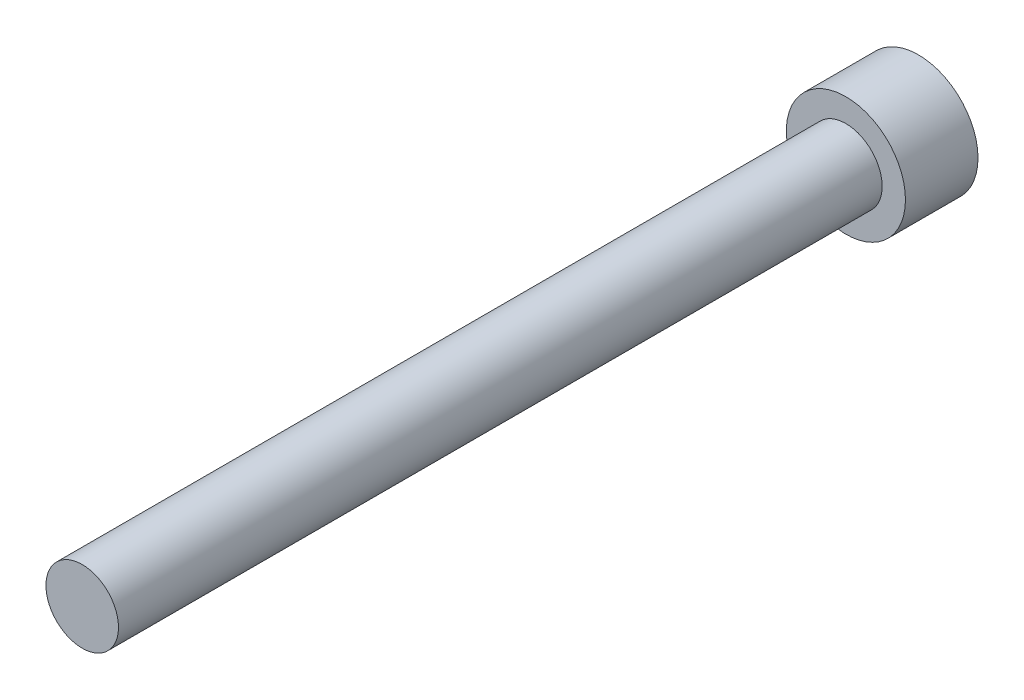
ISO-10303-21;
HEADER;
FILE_DESCRIPTION(('STEP AP214'),'2;1');
FILE_NAME('part.step','',(''),(''),'','','');
FILE_SCHEMA(('AUTOMOTIVE_DESIGN { 1 0 10303 214 1 1 1 1 }'));
ENDSEC;
DATA;
#1=APPLICATION_CONTEXT('core data for automotive mechanical design processes');
#2=APPLICATION_PROTOCOL_DEFINITION('international standard','automotive_design',2000,#1);
#3=PRODUCT_CONTEXT('',#1,'mechanical');
#4=PRODUCT('Part','Part','',(#3));
#5=PRODUCT_RELATED_PRODUCT_CATEGORY('part','',(#4));
#6=PRODUCT_DEFINITION_FORMATION('','',#4);
#7=PRODUCT_DEFINITION_CONTEXT('part definition',#1,'design');
#8=PRODUCT_DEFINITION('design','',#6,#7);
#9=PRODUCT_DEFINITION_SHAPE('','',#8);
#10=(LENGTH_UNIT() NAMED_UNIT(*) SI_UNIT(.MILLI.,.METRE.));
#11=(NAMED_UNIT(*) PLANE_ANGLE_UNIT() SI_UNIT($,.RADIAN.));
#12=(NAMED_UNIT(*) SI_UNIT($,.STERADIAN.) SOLID_ANGLE_UNIT());
#13=UNCERTAINTY_MEASURE_WITH_UNIT(LENGTH_MEASURE(1.E-05),#10,'distance_accuracy_value','');
#14=(GEOMETRIC_REPRESENTATION_CONTEXT(3) GLOBAL_UNCERTAINTY_ASSIGNED_CONTEXT((#13)) GLOBAL_UNIT_ASSIGNED_CONTEXT((#10,
#11,#12)) REPRESENTATION_CONTEXT('',''));
#15=CARTESIAN_POINT('',(0.,0.,0.));
#16=DIRECTION('',(0.,0.,1.));
#17=DIRECTION('',(1.,0.,0.));
#18=AXIS2_PLACEMENT_3D('',#15,#16,#17);
#19=CARTESIAN_POINT('',(0.,0.,50.8));
#20=DIRECTION('',(0.,0.,1.));
#21=DIRECTION('',(1.,0.,0.));
#22=AXIS2_PLACEMENT_3D('',#19,#20,#21);
#23=PLANE('',#22);
#24=CARTESIAN_POINT('',(0.,0.,50.8));
#25=DIRECTION('',(0.,0.,1.));
#26=DIRECTION('',(1.,0.,0.));
#27=AXIS2_PLACEMENT_3D('',#24,#25,#26);
#28=CIRCLE('',#27,2.413);
#29=CARTESIAN_POINT('',(2.413,0.,50.8));
#30=VERTEX_POINT('',#29);
#31=EDGE_CURVE('E11',#30,#30,#28,.T.);
#32=ORIENTED_EDGE('',*,*,#31,.T.);
#33=EDGE_LOOP('',(#32));
#34=FACE_BOUND('',#33,.T.);
#35=ADVANCED_FACE('F37',(#34),#23,.T.);
#36=CARTESIAN_POINT('',(0.,0.,50.8));
#37=DIRECTION('',(0.,0.,1.));
#38=DIRECTION('',(1.,0.,0.));
#39=AXIS2_PLACEMENT_3D('',#36,#37,#38);
#40=CYLINDRICAL_SURFACE('',#39,2.413);
#41=CARTESIAN_POINT('',(0.,0.,0.));
#42=DIRECTION('',(0.,0.,1.));
#43=DIRECTION('',(1.,0.,0.));
#44=AXIS2_PLACEMENT_3D('',#41,#42,#43);
#45=CIRCLE('',#44,2.413);
#46=CARTESIAN_POINT('',(2.413,0.,0.));
#47=VERTEX_POINT('',#46);
#48=EDGE_CURVE('E44',#47,#47,#45,.T.);
#49=ORIENTED_EDGE('',*,*,#48,.T.);
#50=EDGE_LOOP('',(#49));
#51=FACE_BOUND('',#50,.T.);
#52=ORIENTED_EDGE('',*,*,#31,.F.);
#53=EDGE_LOOP('',(#52));
#54=FACE_BOUND('',#53,.T.);
#55=ADVANCED_FACE('F151',(#51,#54),#40,.T.);
#56=CARTESIAN_POINT('',(0.,-2.413,0.));
#57=DIRECTION('',(0.,0.,1.));
#58=DIRECTION('',(1.,0.,0.));
#59=AXIS2_PLACEMENT_3D('',#56,#57,#58);
#60=PLANE('',#59);
#61=CARTESIAN_POINT('',(0.,0.,0.));
#62=DIRECTION('',(0.,0.,1.));
#63=DIRECTION('',(1.,0.,0.));
#64=AXIS2_PLACEMENT_3D('',#61,#62,#63);
#65=CIRCLE('',#64,3.9624);
#66=CARTESIAN_POINT('',(3.9624,0.,0.));
#67=VERTEX_POINT('',#66);
#68=EDGE_CURVE('E146',#67,#67,#65,.T.);
#69=ORIENTED_EDGE('',*,*,#68,.T.);
#70=EDGE_LOOP('',(#69));
#71=FACE_BOUND('',#70,.T.);
#72=ORIENTED_EDGE('',*,*,#48,.F.);
#73=EDGE_LOOP('',(#72));
#74=FACE_BOUND('',#73,.T.);
#75=ADVANCED_FACE('F154',(#71,#74),#60,.T.);
#76=CARTESIAN_POINT('',(0.,0.,50.8));
#77=DIRECTION('',(0.,0.,1.));
#78=DIRECTION('',(1.,0.,0.));
#79=AXIS2_PLACEMENT_3D('',#76,#77,#78);
#80=CYLINDRICAL_SURFACE('',#79,3.9624);
#81=CARTESIAN_POINT('',(0.,0.,-4.826));
#82=DIRECTION('',(0.,0.,1.));
#83=DIRECTION('',(1.,0.,0.));
#84=AXIS2_PLACEMENT_3D('',#81,#82,#83);
#85=CIRCLE('',#84,3.9624);
#86=CARTESIAN_POINT('',(3.9624,0.,-4.826));
#87=VERTEX_POINT('',#86);
#88=EDGE_CURVE('E138',#87,#87,#85,.T.);
#89=ORIENTED_EDGE('',*,*,#88,.T.);
#90=EDGE_LOOP('',(#89));
#91=FACE_BOUND('',#90,.T.);
#92=ORIENTED_EDGE('',*,*,#68,.F.);
#93=EDGE_LOOP('',(#92));
#94=FACE_BOUND('',#93,.T.);
#95=ADVANCED_FACE('F156',(#91,#94),#80,.T.);
#96=CARTESIAN_POINT('',(0.,-3.9624,-4.826));
#97=DIRECTION('',(0.,0.,-1.));
#98=DIRECTION('',(-1.,0.,0.));
#99=AXIS2_PLACEMENT_3D('',#96,#97,#98);
#100=PLANE('',#99);
#101=DIRECTION('',(0.866025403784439,-0.5,0.));
#102=VECTOR('',#101,1.);
#103=CARTESIAN_POINT('',(0.,2.28769270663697,-4.826));
#104=LINE('',#103,#102);
#105=CARTESIAN_POINT('',(0.,2.28769270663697,-4.826));
#106=VERTEX_POINT('',#105);
#107=CARTESIAN_POINT('',(1.9812,1.14384635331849,-4.826));
#108=VERTEX_POINT('',#107);
#109=EDGE_CURVE('E51',#106,#108,#104,.T.);
#110=ORIENTED_EDGE('',*,*,#109,.F.);
#111=DIRECTION('',(0.866025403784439,0.5,0.));
#112=VECTOR('',#111,1.);
#113=CARTESIAN_POINT('',(-1.9812,1.14384635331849,-4.826));
#114=LINE('',#113,#112);
#115=CARTESIAN_POINT('',(-1.9812,1.14384635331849,-4.826));
#116=VERTEX_POINT('',#115);
#117=EDGE_CURVE('E134',#116,#106,#114,.T.);
#118=ORIENTED_EDGE('',*,*,#117,.F.);
#119=DIRECTION('',(0.,1.,0.));
#120=VECTOR('',#119,1.);
#121=CARTESIAN_POINT('',(-1.9812,-1.14384635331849,-4.826));
#122=LINE('',#121,#120);
#123=CARTESIAN_POINT('',(-1.9812,-1.14384635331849,-4.826));
#124=VERTEX_POINT('',#123);
#125=EDGE_CURVE('E132',#124,#116,#122,.T.);
#126=ORIENTED_EDGE('',*,*,#125,.F.);
#127=DIRECTION('',(-0.866025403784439,0.5,0.));
#128=VECTOR('',#127,1.);
#129=CARTESIAN_POINT('',(0.,-2.28769270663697,-4.826));
#130=LINE('',#129,#128);
#131=CARTESIAN_POINT('',(0.,-2.28769270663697,-4.826));
#132=VERTEX_POINT('',#131);
#133=EDGE_CURVE('E99',#132,#124,#130,.T.);
#134=ORIENTED_EDGE('',*,*,#133,.F.);
#135=DIRECTION('',(-0.866025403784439,-0.5,0.));
#136=VECTOR('',#135,1.);
#137=CARTESIAN_POINT('',(1.9812,-1.14384635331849,-4.826));
#138=LINE('',#137,#136);
#139=CARTESIAN_POINT('',(1.9812,-1.14384635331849,-4.826));
#140=VERTEX_POINT('',#139);
#141=EDGE_CURVE('E128',#140,#132,#138,.T.);
#142=ORIENTED_EDGE('',*,*,#141,.F.);
#143=DIRECTION('',(0.,-1.,0.));
#144=VECTOR('',#143,1.);
#145=CARTESIAN_POINT('',(1.9812,1.14384635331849,-4.826));
#146=LINE('',#145,#144);
#147=EDGE_CURVE('E125',#108,#140,#146,.T.);
#148=ORIENTED_EDGE('',*,*,#147,.F.);
#149=EDGE_LOOP('',(#110,#118,#126,#134,#142,#148));
#150=FACE_BOUND('',#149,.T.);
#151=ORIENTED_EDGE('',*,*,#88,.F.);
#152=EDGE_LOOP('',(#151));
#153=FACE_BOUND('',#152,.T.);
#154=ADVANCED_FACE('F163',(#150,#153),#100,.T.);
#155=CARTESIAN_POINT('',(0.,2.28769270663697,-1.778));
#156=DIRECTION('',(0.5,0.866025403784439,0.));
#157=DIRECTION('',(-0.866025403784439,0.5,0.));
#158=AXIS2_PLACEMENT_3D('',#155,#156,#157);
#159=PLANE('',#158);
#160=ORIENTED_EDGE('',*,*,#109,.T.);
#161=DIRECTION('',(0.,0.,-1.));
#162=VECTOR('',#161,1.);
#163=CARTESIAN_POINT('',(1.9812,1.14384635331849,-1.778));
#164=LINE('',#163,#162);
#165=CARTESIAN_POINT('',(1.9812,1.14384635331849,-1.778));
#166=VERTEX_POINT('',#165);
#167=EDGE_CURVE('E81',#166,#108,#164,.T.);
#168=ORIENTED_EDGE('',*,*,#167,.F.);
#169=DIRECTION('',(0.866025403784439,-0.5,0.));
#170=VECTOR('',#169,1.);
#171=CARTESIAN_POINT('',(0.,2.28769270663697,-1.778));
#172=LINE('',#171,#170);
#173=CARTESIAN_POINT('',(0.,2.28769270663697,-1.778));
#174=VERTEX_POINT('',#173);
#175=EDGE_CURVE('E136',#174,#166,#172,.T.);
#176=ORIENTED_EDGE('',*,*,#175,.F.);
#177=DIRECTION('',(0.,0.,-1.));
#178=VECTOR('',#177,1.);
#179=CARTESIAN_POINT('',(0.,2.28769270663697,-1.778));
#180=LINE('',#179,#178);
#181=EDGE_CURVE('E59',#174,#106,#180,.T.);
#182=ORIENTED_EDGE('',*,*,#181,.T.);
#183=EDGE_LOOP('',(#160,#168,#176,#182));
#184=FACE_BOUND('',#183,.T.);
#185=ADVANCED_FACE('F197',(#184),#159,.F.);
#186=CARTESIAN_POINT('',(-1.9812,1.14384635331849,-1.778));
#187=DIRECTION('',(-0.5,0.866025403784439,0.));
#188=DIRECTION('',(-0.866025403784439,-0.5,0.));
#189=AXIS2_PLACEMENT_3D('',#186,#187,#188);
#190=PLANE('',#189);
#191=ORIENTED_EDGE('',*,*,#117,.T.);
#192=ORIENTED_EDGE('',*,*,#181,.F.);
#193=DIRECTION('',(0.866025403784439,0.5,0.));
#194=VECTOR('',#193,1.);
#195=CARTESIAN_POINT('',(-1.9812,1.14384635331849,-1.778));
#196=LINE('',#195,#194);
#197=CARTESIAN_POINT('',(-1.9812,1.14384635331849,-1.778));
#198=VERTEX_POINT('',#197);
#199=EDGE_CURVE('E111',#198,#174,#196,.T.);
#200=ORIENTED_EDGE('',*,*,#199,.F.);
#201=DIRECTION('',(0.,0.,-1.));
#202=VECTOR('',#201,1.);
#203=CARTESIAN_POINT('',(-1.9812,1.14384635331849,-1.778));
#204=LINE('',#203,#202);
#205=EDGE_CURVE('E103',#198,#116,#204,.T.);
#206=ORIENTED_EDGE('',*,*,#205,.T.);
#207=EDGE_LOOP('',(#191,#192,#200,#206));
#208=FACE_BOUND('',#207,.T.);
#209=ADVANCED_FACE('F208',(#208),#190,.F.);
#210=CARTESIAN_POINT('',(-1.9812,-1.14384635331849,-1.778));
#211=DIRECTION('',(-1.,0.,0.));
#212=DIRECTION('',(0.,-1.,0.));
#213=AXIS2_PLACEMENT_3D('',#210,#211,#212);
#214=PLANE('',#213);
#215=ORIENTED_EDGE('',*,*,#125,.T.);
#216=ORIENTED_EDGE('',*,*,#205,.F.);
#217=DIRECTION('',(0.,1.,0.));
#218=VECTOR('',#217,1.);
#219=CARTESIAN_POINT('',(-1.9812,-1.14384635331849,-1.778));
#220=LINE('',#219,#218);
#221=CARTESIAN_POINT('',(-1.9812,-1.14384635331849,-1.778));
#222=VERTEX_POINT('',#221);
#223=EDGE_CURVE('E107',#222,#198,#220,.T.);
#224=ORIENTED_EDGE('',*,*,#223,.F.);
#225=DIRECTION('',(0.,0.,-1.));
#226=VECTOR('',#225,1.);
#227=CARTESIAN_POINT('',(-1.9812,-1.14384635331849,-1.778));
#228=LINE('',#227,#226);
#229=EDGE_CURVE('E92',#222,#124,#228,.T.);
#230=ORIENTED_EDGE('',*,*,#229,.T.);
#231=EDGE_LOOP('',(#215,#216,#224,#230));
#232=FACE_BOUND('',#231,.T.);
#233=ADVANCED_FACE('F108',(#232),#214,.F.);
#234=CARTESIAN_POINT('',(0.,-2.28769270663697,-1.778));
#235=DIRECTION('',(-0.5,-0.866025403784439,0.));
#236=DIRECTION('',(0.866025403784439,-0.5,0.));
#237=AXIS2_PLACEMENT_3D('',#234,#235,#236);
#238=PLANE('',#237);
#239=ORIENTED_EDGE('',*,*,#133,.T.);
#240=ORIENTED_EDGE('',*,*,#229,.F.);
#241=DIRECTION('',(-0.866025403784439,0.5,0.));
#242=VECTOR('',#241,1.);
#243=CARTESIAN_POINT('',(0.,-2.28769270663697,-1.778));
#244=LINE('',#243,#242);
#245=CARTESIAN_POINT('',(0.,-2.28769270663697,-1.778));
#246=VERTEX_POINT('',#245);
#247=EDGE_CURVE('E96',#246,#222,#244,.T.);
#248=ORIENTED_EDGE('',*,*,#247,.F.);
#249=DIRECTION('',(0.,0.,-1.));
#250=VECTOR('',#249,1.);
#251=CARTESIAN_POINT('',(0.,-2.28769270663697,-1.778));
#252=LINE('',#251,#250);
#253=EDGE_CURVE('E104',#246,#132,#252,.T.);
#254=ORIENTED_EDGE('',*,*,#253,.T.);
#255=EDGE_LOOP('',(#239,#240,#248,#254));
#256=FACE_BOUND('',#255,.T.);
#257=ADVANCED_FACE('F94',(#256),#238,.F.);
#258=CARTESIAN_POINT('',(1.9812,-1.14384635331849,-1.778));
#259=DIRECTION('',(0.5,-0.866025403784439,0.));
#260=DIRECTION('',(0.866025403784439,0.5,0.));
#261=AXIS2_PLACEMENT_3D('',#258,#259,#260);
#262=PLANE('',#261);
#263=ORIENTED_EDGE('',*,*,#141,.T.);
#264=ORIENTED_EDGE('',*,*,#253,.F.);
#265=DIRECTION('',(-0.866025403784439,-0.5,0.));
#266=VECTOR('',#265,1.);
#267=CARTESIAN_POINT('',(1.9812,-1.14384635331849,-1.778));
#268=LINE('',#267,#266);
#269=CARTESIAN_POINT('',(1.9812,-1.14384635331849,-1.778));
#270=VERTEX_POINT('',#269);
#271=EDGE_CURVE('E117',#270,#246,#268,.T.);
#272=ORIENTED_EDGE('',*,*,#271,.F.);
#273=DIRECTION('',(0.,0.,-1.));
#274=VECTOR('',#273,1.);
#275=CARTESIAN_POINT('',(1.9812,-1.14384635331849,-1.778));
#276=LINE('',#275,#274);
#277=EDGE_CURVE('E141',#270,#140,#276,.T.);
#278=ORIENTED_EDGE('',*,*,#277,.T.);
#279=EDGE_LOOP('',(#263,#264,#272,#278));
#280=FACE_BOUND('',#279,.T.);
#281=ADVANCED_FACE('F236',(#280),#262,.F.);
#282=CARTESIAN_POINT('',(1.9812,1.14384635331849,-1.778));
#283=DIRECTION('',(1.,0.,0.));
#284=DIRECTION('',(0.,0.,-1.));
#285=AXIS2_PLACEMENT_3D('',#282,#283,#284);
#286=PLANE('',#285);
#287=ORIENTED_EDGE('',*,*,#147,.T.);
#288=ORIENTED_EDGE('',*,*,#277,.F.);
#289=DIRECTION('',(0.,-1.,0.));
#290=VECTOR('',#289,1.);
#291=CARTESIAN_POINT('',(1.9812,1.14384635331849,-1.778));
#292=LINE('',#291,#290);
#293=EDGE_CURVE('E119',#166,#270,#292,.T.);
#294=ORIENTED_EDGE('',*,*,#293,.F.);
#295=ORIENTED_EDGE('',*,*,#167,.T.);
#296=EDGE_LOOP('',(#287,#288,#294,#295));
#297=FACE_BOUND('',#296,.T.);
#298=ADVANCED_FACE('F246',(#297),#286,.F.);
#299=CARTESIAN_POINT('',(3.9624,0.,-1.778));
#300=DIRECTION('',(0.,0.,-1.));
#301=DIRECTION('',(-1.,0.,0.));
#302=AXIS2_PLACEMENT_3D('',#299,#300,#301);
#303=PLANE('',#302);
#304=ORIENTED_EDGE('',*,*,#175,.T.);
#305=ORIENTED_EDGE('',*,*,#293,.T.);
#306=ORIENTED_EDGE('',*,*,#271,.T.);
#307=ORIENTED_EDGE('',*,*,#247,.T.);
#308=ORIENTED_EDGE('',*,*,#223,.T.);
#309=ORIENTED_EDGE('',*,*,#199,.T.);
#310=EDGE_LOOP('',(#304,#305,#306,#307,#308,#309));
#311=FACE_BOUND('',#310,.T.);
#312=ADVANCED_FACE('F114',(#311),#303,.T.);
#313=CLOSED_SHELL('',(#35,#55,#75,#95,#154,#185,#209,#233,#257,#281,#298,#312));
#314=MANIFOLD_SOLID_BREP('B2',#313);
#315=ADVANCED_BREP_SHAPE_REPRESENTATION('',(#18,#314),#14);
#316=SHAPE_DEFINITION_REPRESENTATION(#9,#315);
ENDSEC;
END-ISO-10303-21;
